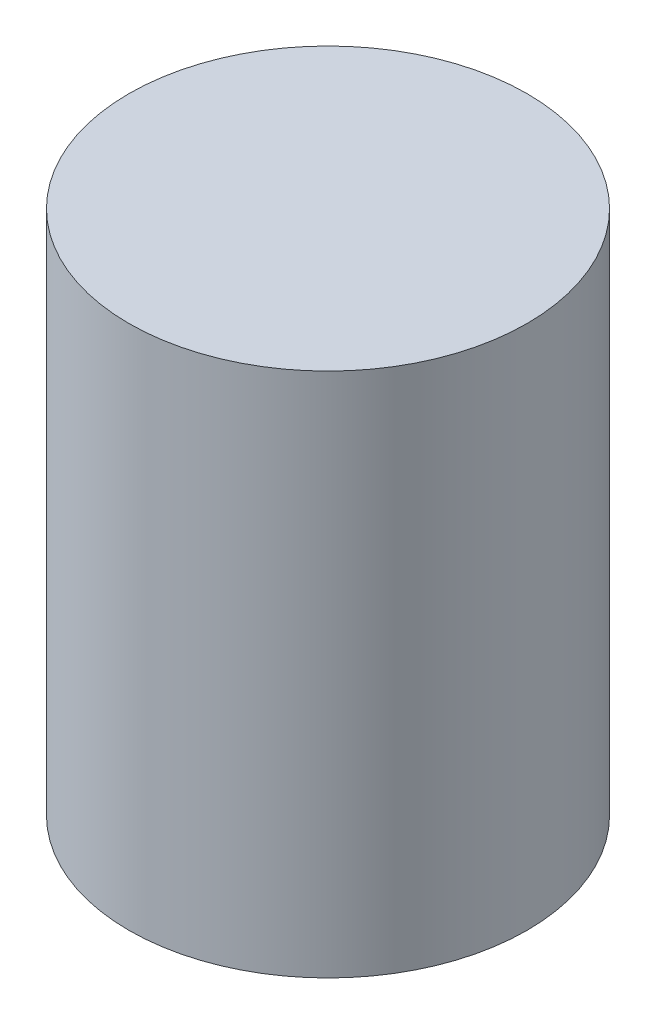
ISO-10303-21;
HEADER;
FILE_DESCRIPTION(('STEP AP214'),'2;1');
FILE_NAME('part.step','',(''),(''),'','','');
FILE_SCHEMA(('AUTOMOTIVE_DESIGN { 1 0 10303 214 1 1 1 1 }'));
ENDSEC;
DATA;
#1=APPLICATION_CONTEXT('core data for automotive mechanical design processes');
#2=APPLICATION_PROTOCOL_DEFINITION('international standard','automotive_design',2000,#1);
#3=PRODUCT_CONTEXT('',#1,'mechanical');
#4=PRODUCT('Part','Part','',(#3));
#5=PRODUCT_RELATED_PRODUCT_CATEGORY('part','',(#4));
#6=PRODUCT_DEFINITION_FORMATION('','',#4);
#7=PRODUCT_DEFINITION_CONTEXT('part definition',#1,'design');
#8=PRODUCT_DEFINITION('design','',#6,#7);
#9=PRODUCT_DEFINITION_SHAPE('','',#8);
#10=(LENGTH_UNIT() NAMED_UNIT(*) SI_UNIT(.MILLI.,.METRE.));
#11=(NAMED_UNIT(*) PLANE_ANGLE_UNIT() SI_UNIT($,.RADIAN.));
#12=(NAMED_UNIT(*) SI_UNIT($,.STERADIAN.) SOLID_ANGLE_UNIT());
#13=UNCERTAINTY_MEASURE_WITH_UNIT(LENGTH_MEASURE(1.E-05),#10,'distance_accuracy_value','');
#14=(GEOMETRIC_REPRESENTATION_CONTEXT(3) GLOBAL_UNCERTAINTY_ASSIGNED_CONTEXT((#13)) GLOBAL_UNIT_ASSIGNED_CONTEXT((#10,
#11,#12)) REPRESENTATION_CONTEXT('',''));
#15=CARTESIAN_POINT('',(0.,0.,0.));
#16=DIRECTION('',(0.,0.,1.));
#17=DIRECTION('',(1.,0.,0.));
#18=AXIS2_PLACEMENT_3D('',#15,#16,#17);
#19=CARTESIAN_POINT('',(0.,-101.546261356,-23.));
#20=DIRECTION('',(0.,-1.,0.));
#21=DIRECTION('',(0.,0.,-1.));
#22=AXIS2_PLACEMENT_3D('',#19,#20,#21);
#23=CONICAL_SURFACE('',#22,0.,1.04719755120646);
#24=CARTESIAN_POINT('',(0.,-101.546261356,-23.));
#25=VERTEX_POINT('',#24);
#26=VERTEX_LOOP('',#25);
#27=FACE_BOUND('',#26,.T.);
#28=CARTESIAN_POINT('',(0.,-104.,-23.));
#29=DIRECTION('',(0.,-1.,0.));
#30=DIRECTION('',(-1.,0.,0.));
#31=AXIS2_PLACEMENT_3D('',#28,#29,#30);
#32=CIRCLE('',#31,4.25);
#33=CARTESIAN_POINT('',(-4.25,-104.,-23.));
#34=VERTEX_POINT('',#33);
#35=EDGE_CURVE('E42',#34,#34,#32,.F.);
#36=ORIENTED_EDGE('',*,*,#35,.F.);
#37=EDGE_LOOP('',(#36));
#38=FACE_BOUND('',#37,.T.);
#39=ADVANCED_FACE('F24',(#27,#38),#23,.F.);
#40=CARTESIAN_POINT('',(0.,-104.,-23.));
#41=DIRECTION('',(0.,-1.,0.));
#42=DIRECTION('',(0.,0.,-1.));
#43=AXIS2_PLACEMENT_3D('',#40,#41,#42);
#44=CYLINDRICAL_SURFACE('',#43,4.25);
#45=CARTESIAN_POINT('',(0.,-132.,-23.));
#46=DIRECTION('',(0.,-1.,0.));
#47=DIRECTION('',(0.,0.,-1.));
#48=AXIS2_PLACEMENT_3D('',#45,#46,#47);
#49=CIRCLE('',#48,4.25);
#50=CARTESIAN_POINT('',(0.,-132.,-27.25));
#51=VERTEX_POINT('',#50);
#52=EDGE_CURVE('E28',#51,#51,#49,.T.);
#53=ORIENTED_EDGE('',*,*,#52,.T.);
#54=EDGE_LOOP('',(#53));
#55=FACE_BOUND('',#54,.T.);
#56=ORIENTED_EDGE('',*,*,#35,.T.);
#57=EDGE_LOOP('',(#56));
#58=FACE_BOUND('',#57,.T.);
#59=ADVANCED_FACE('F38',(#55,#58),#44,.F.);
#60=CARTESIAN_POINT('',(-25.3,-132.,2.3));
#61=DIRECTION('',(0.,1.,0.));
#62=DIRECTION('',(1.,0.,0.));
#63=AXIS2_PLACEMENT_3D('',#60,#61,#62);
#64=PLANE('',#63);
#65=ORIENTED_EDGE('',*,*,#52,.F.);
#66=EDGE_LOOP('',(#65));
#67=FACE_BOUND('',#66,.T.);
#68=CARTESIAN_POINT('',(0.,-132.,-23.));
#69=DIRECTION('',(0.,-1.,0.));
#70=DIRECTION('',(0.,0.,-1.));
#71=AXIS2_PLACEMENT_3D('',#68,#69,#70);
#72=CIRCLE('',#71,25.);
#73=CARTESIAN_POINT('',(0.,-132.,-48.));
#74=VERTEX_POINT('',#73);
#75=EDGE_CURVE('E32',#74,#74,#72,.T.);
#76=ORIENTED_EDGE('',*,*,#75,.T.);
#77=EDGE_LOOP('',(#76));
#78=FACE_BOUND('',#77,.T.);
#79=ADVANCED_FACE('F49',(#67,#78),#64,.F.);
#80=CARTESIAN_POINT('',(-25.3,-66.,2.3));
#81=DIRECTION('',(0.,1.,0.));
#82=DIRECTION('',(1.,0.,0.));
#83=AXIS2_PLACEMENT_3D('',#80,#81,#82);
#84=PLANE('',#83);
#85=CARTESIAN_POINT('',(0.,-66.,-23.));
#86=DIRECTION('',(0.,-1.,0.));
#87=DIRECTION('',(0.,0.,-1.));
#88=AXIS2_PLACEMENT_3D('',#85,#86,#87);
#89=CIRCLE('',#88,25.);
#90=CARTESIAN_POINT('',(0.,-66.,-48.));
#91=VERTEX_POINT('',#90);
#92=EDGE_CURVE('E13',#91,#91,#89,.F.);
#93=ORIENTED_EDGE('',*,*,#92,.T.);
#94=EDGE_LOOP('',(#93));
#95=FACE_BOUND('',#94,.T.);
#96=ADVANCED_FACE('F26',(#95),#84,.T.);
#97=CARTESIAN_POINT('',(0.,-66.,-23.));
#98=DIRECTION('',(0.,-1.,0.));
#99=DIRECTION('',(0.,0.,-1.));
#100=AXIS2_PLACEMENT_3D('',#97,#98,#99);
#101=CYLINDRICAL_SURFACE('',#100,25.);
#102=ORIENTED_EDGE('',*,*,#75,.F.);
#103=EDGE_LOOP('',(#102));
#104=FACE_BOUND('',#103,.T.);
#105=ORIENTED_EDGE('',*,*,#92,.F.);
#106=EDGE_LOOP('',(#105));
#107=FACE_BOUND('',#106,.T.);
#108=ADVANCED_FACE('F51',(#104,#107),#101,.T.);
#109=CLOSED_SHELL('',(#39,#59,#79,#96,#108));
#110=MANIFOLD_SOLID_BREP('B1',#109);
#111=ADVANCED_BREP_SHAPE_REPRESENTATION('',(#18,#110),#14);
#112=SHAPE_DEFINITION_REPRESENTATION(#9,#111);
ENDSEC;
END-ISO-10303-21;
